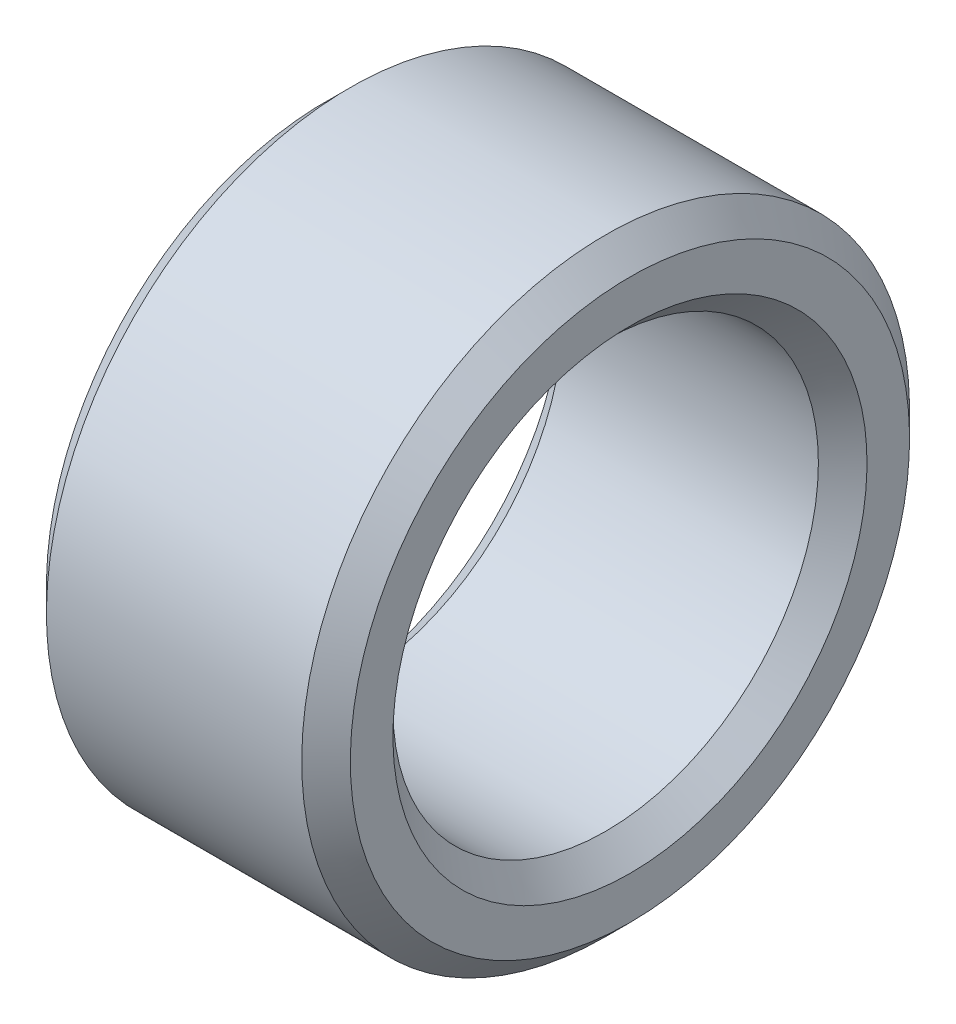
ISO-10303-21;
HEADER;
FILE_DESCRIPTION(('STEP AP214'),'2;1');
FILE_NAME('part.step','',(''),(''),'','','');
FILE_SCHEMA(('AUTOMOTIVE_DESIGN { 1 0 10303 214 1 1 1 1 }'));
ENDSEC;
DATA;
#1=APPLICATION_CONTEXT('core data for automotive mechanical design processes');
#2=APPLICATION_PROTOCOL_DEFINITION('international standard','automotive_design',2000,#1);
#3=PRODUCT_CONTEXT('',#1,'mechanical');
#4=PRODUCT('Part','Part','',(#3));
#5=PRODUCT_RELATED_PRODUCT_CATEGORY('part','',(#4));
#6=PRODUCT_DEFINITION_FORMATION('','',#4);
#7=PRODUCT_DEFINITION_CONTEXT('part definition',#1,'design');
#8=PRODUCT_DEFINITION('design','',#6,#7);
#9=PRODUCT_DEFINITION_SHAPE('','',#8);
#10=(LENGTH_UNIT() NAMED_UNIT(*) SI_UNIT(.MILLI.,.METRE.));
#11=(NAMED_UNIT(*) PLANE_ANGLE_UNIT() SI_UNIT($,.RADIAN.));
#12=(NAMED_UNIT(*) SI_UNIT($,.STERADIAN.) SOLID_ANGLE_UNIT());
#13=UNCERTAINTY_MEASURE_WITH_UNIT(LENGTH_MEASURE(1.E-05),#10,'distance_accuracy_value','');
#14=(GEOMETRIC_REPRESENTATION_CONTEXT(3) GLOBAL_UNCERTAINTY_ASSIGNED_CONTEXT((#13)) GLOBAL_UNIT_ASSIGNED_CONTEXT((#10,
#11,#12)) REPRESENTATION_CONTEXT('',''));
#15=CARTESIAN_POINT('',(0.,0.,0.));
#16=DIRECTION('',(0.,0.,1.));
#17=DIRECTION('',(1.,0.,0.));
#18=AXIS2_PLACEMENT_3D('',#15,#16,#17);
#19=CARTESIAN_POINT('',(0.,-4.25,0.));
#20=DIRECTION('',(-1.,0.,0.));
#21=DIRECTION('',(0.,1.,0.));
#22=AXIS2_PLACEMENT_3D('',#19,#20,#21);
#23=PLANE('',#22);
#24=CARTESIAN_POINT('',(0.,0.,0.));
#25=DIRECTION('',(1.,0.,0.));
#26=DIRECTION('',(0.,-1.,0.));
#27=AXIS2_PLACEMENT_3D('',#24,#25,#26);
#28=CIRCLE('',#27,3.9);
#29=CARTESIAN_POINT('',(0.,-3.9,0.));
#30=VERTEX_POINT('',#29);
#31=EDGE_CURVE('E9',#30,#30,#28,.T.);
#32=ORIENTED_EDGE('',*,*,#31,.T.);
#33=EDGE_LOOP('',(#32));
#34=FACE_BOUND('',#33,.T.);
#35=CARTESIAN_POINT('',(0.,0.,0.));
#36=DIRECTION('',(1.,0.,0.));
#37=DIRECTION('',(0.,-1.,0.));
#38=AXIS2_PLACEMENT_3D('',#35,#36,#37);
#39=CIRCLE('',#38,4.6);
#40=CARTESIAN_POINT('',(0.,-4.6,0.));
#41=VERTEX_POINT('',#40);
#42=EDGE_CURVE('E53',#41,#41,#39,.T.);
#43=ORIENTED_EDGE('',*,*,#42,.F.);
#44=EDGE_LOOP('',(#43));
#45=FACE_BOUND('',#44,.T.);
#46=ADVANCED_FACE('F15',(#34,#45),#23,.T.);
#47=CARTESIAN_POINT('',(0.2,0.,0.));
#48=DIRECTION('',(-1.,0.,0.));
#49=DIRECTION('',(0.,-1.,0.));
#50=AXIS2_PLACEMENT_3D('',#47,#48,#49);
#51=CONICAL_SURFACE('',#50,3.7,0.785398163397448);
#52=CARTESIAN_POINT('',(0.4,0.,0.));
#53=DIRECTION('',(1.,0.,0.));
#54=DIRECTION('',(0.,-1.,0.));
#55=AXIS2_PLACEMENT_3D('',#52,#53,#54);
#56=CIRCLE('',#55,3.5);
#57=CARTESIAN_POINT('',(0.4,-3.5,0.));
#58=VERTEX_POINT('',#57);
#59=EDGE_CURVE('E22',#58,#58,#56,.T.);
#60=ORIENTED_EDGE('',*,*,#59,.T.);
#61=EDGE_LOOP('',(#60));
#62=FACE_BOUND('',#61,.T.);
#63=ORIENTED_EDGE('',*,*,#31,.F.);
#64=EDGE_LOOP('',(#63));
#65=FACE_BOUND('',#64,.T.);
#66=ADVANCED_FACE('F82',(#62,#65),#51,.F.);
#67=CARTESIAN_POINT('',(2.5,0.,0.));
#68=DIRECTION('',(-1.,0.,0.));
#69=DIRECTION('',(0.,-1.,0.));
#70=AXIS2_PLACEMENT_3D('',#67,#68,#69);
#71=CYLINDRICAL_SURFACE('',#70,3.5);
#72=CARTESIAN_POINT('',(4.6,0.,0.));
#73=DIRECTION('',(1.,0.,0.));
#74=DIRECTION('',(0.,-1.,0.));
#75=AXIS2_PLACEMENT_3D('',#72,#73,#74);
#76=CIRCLE('',#75,3.5);
#77=CARTESIAN_POINT('',(4.6,-3.5,0.));
#78=VERTEX_POINT('',#77);
#79=EDGE_CURVE('E58',#78,#78,#76,.T.);
#80=ORIENTED_EDGE('',*,*,#79,.T.);
#81=EDGE_LOOP('',(#80));
#82=FACE_BOUND('',#81,.T.);
#83=ORIENTED_EDGE('',*,*,#59,.F.);
#84=EDGE_LOOP('',(#83));
#85=FACE_BOUND('',#84,.T.);
#86=ADVANCED_FACE('F66',(#82,#85),#71,.F.);
#87=CARTESIAN_POINT('',(4.8,0.,0.));
#88=DIRECTION('',(1.,0.,0.));
#89=DIRECTION('',(0.,-1.,0.));
#90=AXIS2_PLACEMENT_3D('',#87,#88,#89);
#91=CONICAL_SURFACE('',#90,3.7,0.785398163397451);
#92=CARTESIAN_POINT('',(5.,0.,0.));
#93=DIRECTION('',(1.,0.,0.));
#94=DIRECTION('',(0.,-1.,0.));
#95=AXIS2_PLACEMENT_3D('',#92,#93,#94);
#96=CIRCLE('',#95,3.9);
#97=CARTESIAN_POINT('',(5.,-3.9,0.));
#98=VERTEX_POINT('',#97);
#99=EDGE_CURVE('E63',#98,#98,#96,.T.);
#100=ORIENTED_EDGE('',*,*,#99,.T.);
#101=EDGE_LOOP('',(#100));
#102=FACE_BOUND('',#101,.T.);
#103=ORIENTED_EDGE('',*,*,#79,.F.);
#104=EDGE_LOOP('',(#103));
#105=FACE_BOUND('',#104,.T.);
#106=ADVANCED_FACE('F69',(#102,#105),#91,.F.);
#107=CARTESIAN_POINT('',(5.,-4.25,0.));
#108=DIRECTION('',(1.,0.,0.));
#109=DIRECTION('',(0.,-1.,0.));
#110=AXIS2_PLACEMENT_3D('',#107,#108,#109);
#111=PLANE('',#110);
#112=CARTESIAN_POINT('',(5.,0.,0.));
#113=DIRECTION('',(1.,0.,0.));
#114=DIRECTION('',(0.,-1.,0.));
#115=AXIS2_PLACEMENT_3D('',#112,#113,#114);
#116=CIRCLE('',#115,4.6);
#117=CARTESIAN_POINT('',(5.,-4.6,0.));
#118=VERTEX_POINT('',#117);
#119=EDGE_CURVE('E61',#118,#118,#116,.T.);
#120=ORIENTED_EDGE('',*,*,#119,.T.);
#121=EDGE_LOOP('',(#120));
#122=FACE_BOUND('',#121,.T.);
#123=ORIENTED_EDGE('',*,*,#99,.F.);
#124=EDGE_LOOP('',(#123));
#125=FACE_BOUND('',#124,.T.);
#126=ADVANCED_FACE('F71',(#122,#125),#111,.T.);
#127=CARTESIAN_POINT('',(4.8,0.,0.));
#128=DIRECTION('',(-1.,0.,0.));
#129=DIRECTION('',(0.,-1.,0.));
#130=AXIS2_PLACEMENT_3D('',#127,#128,#129);
#131=CONICAL_SURFACE('',#130,4.8,0.78539816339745);
#132=CARTESIAN_POINT('',(4.6,0.,0.));
#133=DIRECTION('',(1.,0.,0.));
#134=DIRECTION('',(0.,-1.,0.));
#135=AXIS2_PLACEMENT_3D('',#132,#133,#134);
#136=CIRCLE('',#135,5.);
#137=CARTESIAN_POINT('',(4.6,-5.,0.));
#138=VERTEX_POINT('',#137);
#139=EDGE_CURVE('E55',#138,#138,#136,.T.);
#140=ORIENTED_EDGE('',*,*,#139,.T.);
#141=EDGE_LOOP('',(#140));
#142=FACE_BOUND('',#141,.T.);
#143=ORIENTED_EDGE('',*,*,#119,.F.);
#144=EDGE_LOOP('',(#143));
#145=FACE_BOUND('',#144,.T.);
#146=ADVANCED_FACE('F79',(#142,#145),#131,.T.);
#147=CARTESIAN_POINT('',(2.5,0.,0.));
#148=DIRECTION('',(-1.,0.,0.));
#149=DIRECTION('',(0.,-1.,0.));
#150=AXIS2_PLACEMENT_3D('',#147,#148,#149);
#151=CYLINDRICAL_SURFACE('',#150,5.);
#152=CARTESIAN_POINT('',(0.4,0.,0.));
#153=DIRECTION('',(1.,0.,0.));
#154=DIRECTION('',(0.,-1.,0.));
#155=AXIS2_PLACEMENT_3D('',#152,#153,#154);
#156=CIRCLE('',#155,5.);
#157=CARTESIAN_POINT('',(0.4,-5.,0.));
#158=VERTEX_POINT('',#157);
#159=EDGE_CURVE('E49',#158,#158,#156,.T.);
#160=ORIENTED_EDGE('',*,*,#159,.T.);
#161=EDGE_LOOP('',(#160));
#162=FACE_BOUND('',#161,.T.);
#163=ORIENTED_EDGE('',*,*,#139,.F.);
#164=EDGE_LOOP('',(#163));
#165=FACE_BOUND('',#164,.T.);
#166=ADVANCED_FACE('F50',(#162,#165),#151,.T.);
#167=CARTESIAN_POINT('',(0.2,0.,0.));
#168=DIRECTION('',(1.,0.,0.));
#169=DIRECTION('',(0.,-1.,0.));
#170=AXIS2_PLACEMENT_3D('',#167,#168,#169);
#171=CONICAL_SURFACE('',#170,4.8,0.785398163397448);
#172=ORIENTED_EDGE('',*,*,#42,.T.);
#173=EDGE_LOOP('',(#172));
#174=FACE_BOUND('',#173,.T.);
#175=ORIENTED_EDGE('',*,*,#159,.F.);
#176=EDGE_LOOP('',(#175));
#177=FACE_BOUND('',#176,.T.);
#178=ADVANCED_FACE('F92',(#174,#177),#171,.T.);
#179=CLOSED_SHELL('',(#46,#66,#86,#106,#126,#146,#166,#178));
#180=MANIFOLD_SOLID_BREP('B1',#179);
#181=ADVANCED_BREP_SHAPE_REPRESENTATION('',(#18,#180),#14);
#182=SHAPE_DEFINITION_REPRESENTATION(#9,#181);
ENDSEC;
END-ISO-10303-21;
